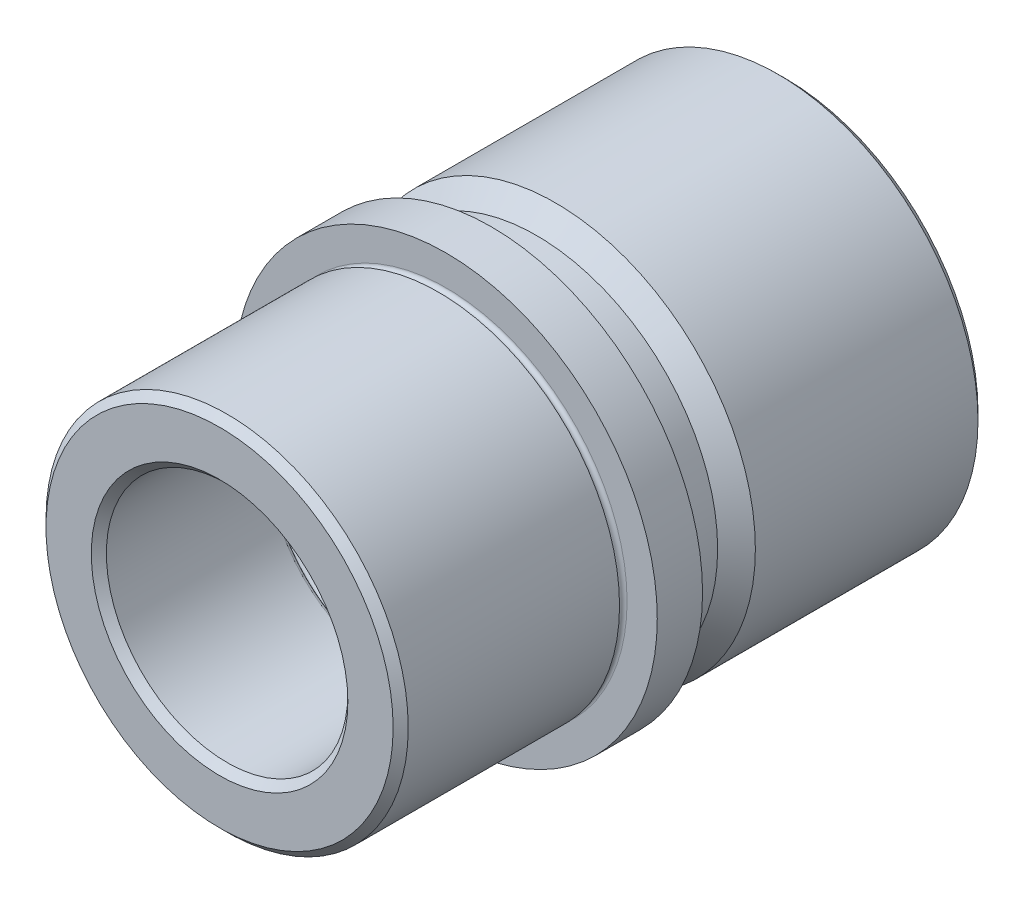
ISO-10303-21;
HEADER;
FILE_DESCRIPTION(('STEP AP214'),'2;1');
FILE_NAME('part.step','',(''),(''),'','','');
FILE_SCHEMA(('AUTOMOTIVE_DESIGN { 1 0 10303 214 1 1 1 1 }'));
ENDSEC;
DATA;
#1=APPLICATION_CONTEXT('core data for automotive mechanical design processes');
#2=APPLICATION_PROTOCOL_DEFINITION('international standard','automotive_design',2000,#1);
#3=PRODUCT_CONTEXT('',#1,'mechanical');
#4=PRODUCT('Part','Part','',(#3));
#5=PRODUCT_RELATED_PRODUCT_CATEGORY('part','',(#4));
#6=PRODUCT_DEFINITION_FORMATION('','',#4);
#7=PRODUCT_DEFINITION_CONTEXT('part definition',#1,'design');
#8=PRODUCT_DEFINITION('design','',#6,#7);
#9=PRODUCT_DEFINITION_SHAPE('','',#8);
#10=(LENGTH_UNIT() NAMED_UNIT(*) SI_UNIT(.MILLI.,.METRE.));
#11=(NAMED_UNIT(*) PLANE_ANGLE_UNIT() SI_UNIT($,.RADIAN.));
#12=(NAMED_UNIT(*) SI_UNIT($,.STERADIAN.) SOLID_ANGLE_UNIT());
#13=UNCERTAINTY_MEASURE_WITH_UNIT(LENGTH_MEASURE(1.E-05),#10,'distance_accuracy_value','');
#14=(GEOMETRIC_REPRESENTATION_CONTEXT(3) GLOBAL_UNCERTAINTY_ASSIGNED_CONTEXT((#13)) GLOBAL_UNIT_ASSIGNED_CONTEXT((#10,
#11,#12)) REPRESENTATION_CONTEXT('',''));
#15=CARTESIAN_POINT('',(0.,0.,0.));
#16=DIRECTION('',(0.,0.,1.));
#17=DIRECTION('',(1.,0.,0.));
#18=AXIS2_PLACEMENT_3D('',#15,#16,#17);
#19=CARTESIAN_POINT('',(0.,0.,-47.5));
#20=DIRECTION('',(0.,0.,1.));
#21=DIRECTION('',(1.,0.,0.));
#22=AXIS2_PLACEMENT_3D('',#19,#20,#21);
#23=TOROIDAL_SURFACE('',#22,16.5,0.5);
#24=CARTESIAN_POINT('',(0.,0.,-47.5));
#25=DIRECTION('',(0.,0.,1.));
#26=DIRECTION('',(1.,0.,0.));
#27=AXIS2_PLACEMENT_3D('',#24,#25,#26);
#28=CIRCLE('',#27,16.);
#29=CARTESIAN_POINT('',(16.,0.,-47.5));
#30=VERTEX_POINT('',#29);
#31=EDGE_CURVE('E81',#30,#30,#28,.T.);
#32=ORIENTED_EDGE('',*,*,#31,.T.);
#33=EDGE_LOOP('',(#32));
#34=FACE_BOUND('',#33,.T.);
#35=CARTESIAN_POINT('',(0.,0.,-48.));
#36=DIRECTION('',(0.,0.,1.));
#37=DIRECTION('',(1.,0.,0.));
#38=AXIS2_PLACEMENT_3D('',#35,#36,#37);
#39=CIRCLE('',#38,16.5);
#40=CARTESIAN_POINT('',(16.5,0.,-48.));
#41=VERTEX_POINT('',#40);
#42=EDGE_CURVE('E45',#41,#41,#39,.T.);
#43=ORIENTED_EDGE('',*,*,#42,.F.);
#44=EDGE_LOOP('',(#43));
#45=FACE_BOUND('',#44,.T.);
#46=ADVANCED_FACE('F13',(#34,#45),#23,.T.);
#47=CARTESIAN_POINT('',(0.,0.,-48.5));
#48=DIRECTION('',(0.,0.,1.));
#49=DIRECTION('',(1.,0.,0.));
#50=AXIS2_PLACEMENT_3D('',#47,#48,#49);
#51=TOROIDAL_SURFACE('',#50,16.5,0.5);
#52=CARTESIAN_POINT('',(0.,0.,-48.5));
#53=DIRECTION('',(0.,0.,1.));
#54=DIRECTION('',(1.,0.,0.));
#55=AXIS2_PLACEMENT_3D('',#52,#53,#54);
#56=CIRCLE('',#55,16.);
#57=CARTESIAN_POINT('',(16.,0.,-48.5));
#58=VERTEX_POINT('',#57);
#59=EDGE_CURVE('E48',#58,#58,#56,.T.);
#60=ORIENTED_EDGE('',*,*,#59,.F.);
#61=EDGE_LOOP('',(#60));
#62=FACE_BOUND('',#61,.T.);
#63=ORIENTED_EDGE('',*,*,#42,.T.);
#64=EDGE_LOOP('',(#63));
#65=FACE_BOUND('',#64,.T.);
#66=ADVANCED_FACE('F114',(#62,#65),#51,.T.);
#67=CARTESIAN_POINT('',(0.,0.,0.));
#68=DIRECTION('',(0.,0.,1.));
#69=DIRECTION('',(1.,0.,0.));
#70=AXIS2_PLACEMENT_3D('',#67,#68,#69);
#71=CYLINDRICAL_SURFACE('',#70,16.);
#72=CARTESIAN_POINT('',(0.,0.,-74.));
#73=DIRECTION('',(0.,0.,1.));
#74=DIRECTION('',(1.,0.,0.));
#75=AXIS2_PLACEMENT_3D('',#72,#73,#74);
#76=CIRCLE('',#75,16.);
#77=CARTESIAN_POINT('',(16.,0.,-74.));
#78=VERTEX_POINT('',#77);
#79=EDGE_CURVE('E36',#78,#78,#76,.F.);
#80=ORIENTED_EDGE('',*,*,#79,.T.);
#81=EDGE_LOOP('',(#80));
#82=FACE_BOUND('',#81,.T.);
#83=ORIENTED_EDGE('',*,*,#59,.T.);
#84=EDGE_LOOP('',(#83));
#85=FACE_BOUND('',#84,.T.);
#86=ADVANCED_FACE('F120',(#82,#85),#71,.F.);
#87=CARTESIAN_POINT('',(0.,0.,-75.));
#88=DIRECTION('',(0.,0.,1.));
#89=DIRECTION('',(1.,0.,0.));
#90=AXIS2_PLACEMENT_3D('',#87,#88,#89);
#91=PLANE('',#90);
#92=CARTESIAN_POINT('',(0.,0.,-75.));
#93=DIRECTION('',(0.,0.,1.));
#94=DIRECTION('',(1.,0.,0.));
#95=AXIS2_PLACEMENT_3D('',#92,#93,#94);
#96=CIRCLE('',#95,17.);
#97=CARTESIAN_POINT('',(17.,0.,-75.));
#98=VERTEX_POINT('',#97);
#99=EDGE_CURVE('E39',#98,#98,#96,.T.);
#100=ORIENTED_EDGE('',*,*,#99,.T.);
#101=EDGE_LOOP('',(#100));
#102=FACE_BOUND('',#101,.T.);
#103=CARTESIAN_POINT('',(0.,0.,-75.));
#104=DIRECTION('',(0.,0.,1.));
#105=DIRECTION('',(1.,0.,0.));
#106=AXIS2_PLACEMENT_3D('',#103,#104,#105);
#107=CIRCLE('',#106,25.5);
#108=CARTESIAN_POINT('',(25.5,0.,-75.));
#109=VERTEX_POINT('',#108);
#110=EDGE_CURVE('E42',#109,#109,#107,.F.);
#111=ORIENTED_EDGE('',*,*,#110,.T.);
#112=EDGE_LOOP('',(#111));
#113=FACE_BOUND('',#112,.T.);
#114=ADVANCED_FACE('F185',(#102,#113),#91,.F.);
#115=CARTESIAN_POINT('',(0.,0.,0.));
#116=DIRECTION('',(0.,0.,1.));
#117=DIRECTION('',(1.,0.,0.));
#118=AXIS2_PLACEMENT_3D('',#115,#116,#117);
#119=CYLINDRICAL_SURFACE('',#118,26.5);
#120=CARTESIAN_POINT('',(0.,0.,-74.));
#121=DIRECTION('',(0.,0.,1.));
#122=DIRECTION('',(1.,0.,0.));
#123=AXIS2_PLACEMENT_3D('',#120,#121,#122);
#124=CIRCLE('',#123,26.5);
#125=CARTESIAN_POINT('',(26.5,0.,-74.));
#126=VERTEX_POINT('',#125);
#127=EDGE_CURVE('E33',#126,#126,#124,.T.);
#128=ORIENTED_EDGE('',*,*,#127,.T.);
#129=EDGE_LOOP('',(#128));
#130=FACE_BOUND('',#129,.T.);
#131=CARTESIAN_POINT('',(0.,0.,-44.5));
#132=DIRECTION('',(0.,0.,1.));
#133=DIRECTION('',(1.,0.,0.));
#134=AXIS2_PLACEMENT_3D('',#131,#132,#133);
#135=CIRCLE('',#134,26.5);
#136=CARTESIAN_POINT('',(26.5,0.,-44.5));
#137=VERTEX_POINT('',#136);
#138=EDGE_CURVE('E51',#137,#137,#135,.T.);
#139=ORIENTED_EDGE('',*,*,#138,.F.);
#140=EDGE_LOOP('',(#139));
#141=FACE_BOUND('',#140,.T.);
#142=ADVANCED_FACE('F181',(#130,#141),#119,.T.);
#143=CARTESIAN_POINT('',(0.,0.,-42.));
#144=DIRECTION('',(0.,0.,-1.));
#145=DIRECTION('',(-1.,0.,0.));
#146=AXIS2_PLACEMENT_3D('',#143,#144,#145);
#147=CONICAL_SURFACE('',#146,24.,0.78539816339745);
#148=ORIENTED_EDGE('',*,*,#138,.T.);
#149=EDGE_LOOP('',(#148));
#150=FACE_BOUND('',#149,.T.);
#151=CARTESIAN_POINT('',(0.,0.,-42.));
#152=DIRECTION('',(0.,0.,1.));
#153=DIRECTION('',(1.,0.,0.));
#154=AXIS2_PLACEMENT_3D('',#151,#152,#153);
#155=CIRCLE('',#154,24.);
#156=CARTESIAN_POINT('',(24.,0.,-42.));
#157=VERTEX_POINT('',#156);
#158=EDGE_CURVE('E54',#157,#157,#155,.T.);
#159=ORIENTED_EDGE('',*,*,#158,.F.);
#160=EDGE_LOOP('',(#159));
#161=FACE_BOUND('',#160,.T.);
#162=ADVANCED_FACE('F177',(#150,#161),#147,.T.);
#163=CARTESIAN_POINT('',(0.,0.,0.));
#164=DIRECTION('',(0.,0.,1.));
#165=DIRECTION('',(1.,0.,0.));
#166=AXIS2_PLACEMENT_3D('',#163,#164,#165);
#167=CYLINDRICAL_SURFACE('',#166,24.);
#168=ORIENTED_EDGE('',*,*,#158,.T.);
#169=EDGE_LOOP('',(#168));
#170=FACE_BOUND('',#169,.T.);
#171=CARTESIAN_POINT('',(0.,0.,-36.));
#172=DIRECTION('',(0.,0.,1.));
#173=DIRECTION('',(1.,0.,0.));
#174=AXIS2_PLACEMENT_3D('',#171,#172,#173);
#175=CIRCLE('',#174,24.);
#176=CARTESIAN_POINT('',(24.,0.,-36.));
#177=VERTEX_POINT('',#176);
#178=EDGE_CURVE('E57',#177,#177,#175,.T.);
#179=ORIENTED_EDGE('',*,*,#178,.F.);
#180=EDGE_LOOP('',(#179));
#181=FACE_BOUND('',#180,.T.);
#182=ADVANCED_FACE('F173',(#170,#181),#167,.T.);
#183=CARTESIAN_POINT('',(0.,0.,-36.));
#184=DIRECTION('',(0.,0.,-1.));
#185=DIRECTION('',(-1.,0.,0.));
#186=AXIS2_PLACEMENT_3D('',#183,#184,#185);
#187=PLANE('',#186);
#188=ORIENTED_EDGE('',*,*,#178,.T.);
#189=EDGE_LOOP('',(#188));
#190=FACE_BOUND('',#189,.T.);
#191=CARTESIAN_POINT('',(0.,0.,-36.));
#192=DIRECTION('',(0.,0.,1.));
#193=DIRECTION('',(1.,0.,0.));
#194=AXIS2_PLACEMENT_3D('',#191,#192,#193);
#195=CIRCLE('',#194,28.);
#196=CARTESIAN_POINT('',(28.,0.,-36.));
#197=VERTEX_POINT('',#196);
#198=EDGE_CURVE('E60',#197,#197,#195,.T.);
#199=ORIENTED_EDGE('',*,*,#198,.F.);
#200=EDGE_LOOP('',(#199));
#201=FACE_BOUND('',#200,.T.);
#202=ADVANCED_FACE('F169',(#190,#201),#187,.T.);
#203=CARTESIAN_POINT('',(0.,0.,0.));
#204=DIRECTION('',(0.,0.,1.));
#205=DIRECTION('',(1.,0.,0.));
#206=AXIS2_PLACEMENT_3D('',#203,#204,#205);
#207=CYLINDRICAL_SURFACE('',#206,28.);
#208=ORIENTED_EDGE('',*,*,#198,.T.);
#209=EDGE_LOOP('',(#208));
#210=FACE_BOUND('',#209,.T.);
#211=CARTESIAN_POINT('',(0.,0.,-30.));
#212=DIRECTION('',(0.,0.,1.));
#213=DIRECTION('',(1.,0.,0.));
#214=AXIS2_PLACEMENT_3D('',#211,#212,#213);
#215=CIRCLE('',#214,28.);
#216=CARTESIAN_POINT('',(28.,0.,-30.));
#217=VERTEX_POINT('',#216);
#218=EDGE_CURVE('E63',#217,#217,#215,.T.);
#219=ORIENTED_EDGE('',*,*,#218,.F.);
#220=EDGE_LOOP('',(#219));
#221=FACE_BOUND('',#220,.T.);
#222=ADVANCED_FACE('F165',(#210,#221),#207,.T.);
#223=CARTESIAN_POINT('',(0.,0.,-30.));
#224=DIRECTION('',(0.,0.,1.));
#225=DIRECTION('',(1.,0.,0.));
#226=AXIS2_PLACEMENT_3D('',#223,#224,#225);
#227=PLANE('',#226);
#228=ORIENTED_EDGE('',*,*,#218,.T.);
#229=EDGE_LOOP('',(#228));
#230=FACE_BOUND('',#229,.T.);
#231=CARTESIAN_POINT('',(0.,0.,-30.));
#232=DIRECTION('',(0.,0.,1.));
#233=DIRECTION('',(1.,0.,0.));
#234=AXIS2_PLACEMENT_3D('',#231,#232,#233);
#235=CIRCLE('',#234,24.);
#236=CARTESIAN_POINT('',(24.,0.,-30.));
#237=VERTEX_POINT('',#236);
#238=EDGE_CURVE('E66',#237,#237,#235,.T.);
#239=ORIENTED_EDGE('',*,*,#238,.F.);
#240=EDGE_LOOP('',(#239));
#241=FACE_BOUND('',#240,.T.);
#242=ADVANCED_FACE('F161',(#230,#241),#227,.T.);
#243=CARTESIAN_POINT('',(0.,0.,-29.5));
#244=DIRECTION('',(0.,0.,1.));
#245=DIRECTION('',(1.,0.,0.));
#246=AXIS2_PLACEMENT_3D('',#243,#244,#245);
#247=TOROIDAL_SURFACE('',#246,24.,0.5);
#248=ORIENTED_EDGE('',*,*,#238,.T.);
#249=EDGE_LOOP('',(#248));
#250=FACE_BOUND('',#249,.T.);
#251=CARTESIAN_POINT('',(0.,0.,-29.));
#252=DIRECTION('',(0.,0.,1.));
#253=DIRECTION('',(1.,0.,0.));
#254=AXIS2_PLACEMENT_3D('',#251,#252,#253);
#255=CIRCLE('',#254,24.);
#256=CARTESIAN_POINT('',(24.,0.,-29.));
#257=VERTEX_POINT('',#256);
#258=EDGE_CURVE('E69',#257,#257,#255,.T.);
#259=ORIENTED_EDGE('',*,*,#258,.F.);
#260=EDGE_LOOP('',(#259));
#261=FACE_BOUND('',#260,.T.);
#262=ADVANCED_FACE('F156',(#250,#261),#247,.F.);
#263=CARTESIAN_POINT('',(0.,0.,0.));
#264=DIRECTION('',(0.,0.,1.));
#265=DIRECTION('',(1.,0.,0.));
#266=AXIS2_PLACEMENT_3D('',#263,#264,#265);
#267=CYLINDRICAL_SURFACE('',#266,24.);
#268=CARTESIAN_POINT('',(0.,0.,-1.));
#269=DIRECTION('',(0.,0.,1.));
#270=DIRECTION('',(1.,0.,0.));
#271=AXIS2_PLACEMENT_3D('',#268,#269,#270);
#272=CIRCLE('',#271,24.);
#273=CARTESIAN_POINT('',(24.,0.,-1.));
#274=VERTEX_POINT('',#273);
#275=EDGE_CURVE('E8',#274,#274,#272,.F.);
#276=ORIENTED_EDGE('',*,*,#275,.T.);
#277=EDGE_LOOP('',(#276));
#278=FACE_BOUND('',#277,.T.);
#279=ORIENTED_EDGE('',*,*,#258,.T.);
#280=EDGE_LOOP('',(#279));
#281=FACE_BOUND('',#280,.T.);
#282=ADVANCED_FACE('F150',(#278,#281),#267,.T.);
#283=CARTESIAN_POINT('',(0.,0.,0.));
#284=DIRECTION('',(0.,0.,1.));
#285=DIRECTION('',(1.,0.,0.));
#286=AXIS2_PLACEMENT_3D('',#283,#284,#285);
#287=PLANE('',#286);
#288=CARTESIAN_POINT('',(0.,0.,0.));
#289=DIRECTION('',(0.,0.,1.));
#290=DIRECTION('',(1.,0.,0.));
#291=AXIS2_PLACEMENT_3D('',#288,#289,#290);
#292=CIRCLE('',#291,17.);
#293=CARTESIAN_POINT('',(17.,0.,0.));
#294=VERTEX_POINT('',#293);
#295=EDGE_CURVE('E20',#294,#294,#292,.F.);
#296=ORIENTED_EDGE('',*,*,#295,.T.);
#297=EDGE_LOOP('',(#296));
#298=FACE_BOUND('',#297,.T.);
#299=CARTESIAN_POINT('',(0.,0.,0.));
#300=DIRECTION('',(0.,0.,1.));
#301=DIRECTION('',(1.,0.,0.));
#302=AXIS2_PLACEMENT_3D('',#299,#300,#301);
#303=CIRCLE('',#302,23.);
#304=CARTESIAN_POINT('',(23.,0.,0.));
#305=VERTEX_POINT('',#304);
#306=EDGE_CURVE('E24',#305,#305,#303,.T.);
#307=ORIENTED_EDGE('',*,*,#306,.T.);
#308=EDGE_LOOP('',(#307));
#309=FACE_BOUND('',#308,.T.);
#310=ADVANCED_FACE('F110',(#298,#309),#287,.T.);
#311=CARTESIAN_POINT('',(0.,0.,0.));
#312=DIRECTION('',(0.,0.,1.));
#313=DIRECTION('',(1.,0.,0.));
#314=AXIS2_PLACEMENT_3D('',#311,#312,#313);
#315=CYLINDRICAL_SURFACE('',#314,16.);
#316=CARTESIAN_POINT('',(0.,0.,-1.));
#317=DIRECTION('',(0.,0.,1.));
#318=DIRECTION('',(1.,0.,0.));
#319=AXIS2_PLACEMENT_3D('',#316,#317,#318);
#320=CIRCLE('',#319,16.);
#321=CARTESIAN_POINT('',(16.,0.,-1.));
#322=VERTEX_POINT('',#321);
#323=EDGE_CURVE('E28',#322,#322,#320,.T.);
#324=ORIENTED_EDGE('',*,*,#323,.T.);
#325=EDGE_LOOP('',(#324));
#326=FACE_BOUND('',#325,.T.);
#327=CARTESIAN_POINT('',(0.,0.,-22.5));
#328=DIRECTION('',(0.,0.,1.));
#329=DIRECTION('',(1.,0.,0.));
#330=AXIS2_PLACEMENT_3D('',#327,#328,#329);
#331=CIRCLE('',#330,16.);
#332=CARTESIAN_POINT('',(16.,0.,-22.5));
#333=VERTEX_POINT('',#332);
#334=EDGE_CURVE('E72',#333,#333,#331,.T.);
#335=ORIENTED_EDGE('',*,*,#334,.F.);
#336=EDGE_LOOP('',(#335));
#337=FACE_BOUND('',#336,.T.);
#338=ADVANCED_FACE('F102',(#326,#337),#315,.F.);
#339=CARTESIAN_POINT('',(0.,0.,-22.5));
#340=DIRECTION('',(0.,0.,1.));
#341=DIRECTION('',(1.,0.,0.));
#342=AXIS2_PLACEMENT_3D('',#339,#340,#341);
#343=TOROIDAL_SURFACE('',#342,16.5,0.5);
#344=ORIENTED_EDGE('',*,*,#334,.T.);
#345=EDGE_LOOP('',(#344));
#346=FACE_BOUND('',#345,.T.);
#347=CARTESIAN_POINT('',(0.,0.,-23.));
#348=DIRECTION('',(0.,0.,1.));
#349=DIRECTION('',(1.,0.,0.));
#350=AXIS2_PLACEMENT_3D('',#347,#348,#349);
#351=CIRCLE('',#350,16.5);
#352=CARTESIAN_POINT('',(16.5,0.,-23.));
#353=VERTEX_POINT('',#352);
#354=EDGE_CURVE('E75',#353,#353,#351,.T.);
#355=ORIENTED_EDGE('',*,*,#354,.F.);
#356=EDGE_LOOP('',(#355));
#357=FACE_BOUND('',#356,.T.);
#358=ADVANCED_FACE('F97',(#346,#357),#343,.T.);
#359=CARTESIAN_POINT('',(0.,0.,-23.5));
#360=DIRECTION('',(0.,0.,1.));
#361=DIRECTION('',(1.,0.,0.));
#362=AXIS2_PLACEMENT_3D('',#359,#360,#361);
#363=TOROIDAL_SURFACE('',#362,16.5,0.5);
#364=CARTESIAN_POINT('',(0.,0.,-23.5));
#365=DIRECTION('',(0.,0.,1.));
#366=DIRECTION('',(1.,0.,0.));
#367=AXIS2_PLACEMENT_3D('',#364,#365,#366);
#368=CIRCLE('',#367,16.);
#369=CARTESIAN_POINT('',(16.,0.,-23.5));
#370=VERTEX_POINT('',#369);
#371=EDGE_CURVE('E78',#370,#370,#368,.T.);
#372=ORIENTED_EDGE('',*,*,#371,.F.);
#373=EDGE_LOOP('',(#372));
#374=FACE_BOUND('',#373,.T.);
#375=ORIENTED_EDGE('',*,*,#354,.T.);
#376=EDGE_LOOP('',(#375));
#377=FACE_BOUND('',#376,.T.);
#378=ADVANCED_FACE('F91',(#374,#377),#363,.T.);
#379=CARTESIAN_POINT('',(0.,0.,0.));
#380=DIRECTION('',(0.,0.,1.));
#381=DIRECTION('',(1.,0.,0.));
#382=AXIS2_PLACEMENT_3D('',#379,#380,#381);
#383=CYLINDRICAL_SURFACE('',#382,16.);
#384=ORIENTED_EDGE('',*,*,#31,.F.);
#385=EDGE_LOOP('',(#384));
#386=FACE_BOUND('',#385,.T.);
#387=ORIENTED_EDGE('',*,*,#371,.T.);
#388=EDGE_LOOP('',(#387));
#389=FACE_BOUND('',#388,.T.);
#390=ADVANCED_FACE('F87',(#386,#389),#383,.F.);
#391=CARTESIAN_POINT('',(0.,0.,-75.));
#392=DIRECTION('',(0.,0.,-1.));
#393=DIRECTION('',(-1.,0.,0.));
#394=AXIS2_PLACEMENT_3D('',#391,#392,#393);
#395=CONICAL_SURFACE('',#394,17.,0.785398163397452);
#396=ORIENTED_EDGE('',*,*,#79,.F.);
#397=EDGE_LOOP('',(#396));
#398=FACE_BOUND('',#397,.T.);
#399=ORIENTED_EDGE('',*,*,#99,.F.);
#400=EDGE_LOOP('',(#399));
#401=FACE_BOUND('',#400,.T.);
#402=ADVANCED_FACE('F90',(#398,#401),#395,.F.);
#403=CARTESIAN_POINT('',(0.,0.,-74.));
#404=DIRECTION('',(0.,0.,1.));
#405=DIRECTION('',(1.,0.,0.));
#406=AXIS2_PLACEMENT_3D('',#403,#404,#405);
#407=CONICAL_SURFACE('',#406,26.5,0.78539816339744);
#408=ORIENTED_EDGE('',*,*,#110,.F.);
#409=EDGE_LOOP('',(#408));
#410=FACE_BOUND('',#409,.T.);
#411=ORIENTED_EDGE('',*,*,#127,.F.);
#412=EDGE_LOOP('',(#411));
#413=FACE_BOUND('',#412,.T.);
#414=ADVANCED_FACE('F127',(#410,#413),#407,.T.);
#415=CARTESIAN_POINT('',(0.,0.,-1.));
#416=DIRECTION('',(0.,0.,1.));
#417=DIRECTION('',(1.,0.,0.));
#418=AXIS2_PLACEMENT_3D('',#415,#416,#417);
#419=CONICAL_SURFACE('',#418,16.,0.785398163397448);
#420=ORIENTED_EDGE('',*,*,#295,.F.);
#421=EDGE_LOOP('',(#420));
#422=FACE_BOUND('',#421,.T.);
#423=ORIENTED_EDGE('',*,*,#323,.F.);
#424=EDGE_LOOP('',(#423));
#425=FACE_BOUND('',#424,.T.);
#426=ADVANCED_FACE('F130',(#422,#425),#419,.F.);
#427=CARTESIAN_POINT('',(0.,0.,0.));
#428=DIRECTION('',(0.,0.,-1.));
#429=DIRECTION('',(-1.,0.,0.));
#430=AXIS2_PLACEMENT_3D('',#427,#428,#429);
#431=CONICAL_SURFACE('',#430,23.,0.785398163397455);
#432=ORIENTED_EDGE('',*,*,#275,.F.);
#433=EDGE_LOOP('',(#432));
#434=FACE_BOUND('',#433,.T.);
#435=ORIENTED_EDGE('',*,*,#306,.F.);
#436=EDGE_LOOP('',(#435));
#437=FACE_BOUND('',#436,.T.);
#438=ADVANCED_FACE('F15',(#434,#437),#431,.T.);
#439=CLOSED_SHELL('',(#46,#66,#86,#114,#142,#162,#182,#202,#222,#242,#262,#282,#310,#338,#358,
#378,#390,#402,#414,#426,#438));
#440=MANIFOLD_SOLID_BREP('B1',#439);
#441=ADVANCED_BREP_SHAPE_REPRESENTATION('',(#18,#440),#14);
#442=SHAPE_DEFINITION_REPRESENTATION(#9,#441);
ENDSEC;
END-ISO-10303-21;
